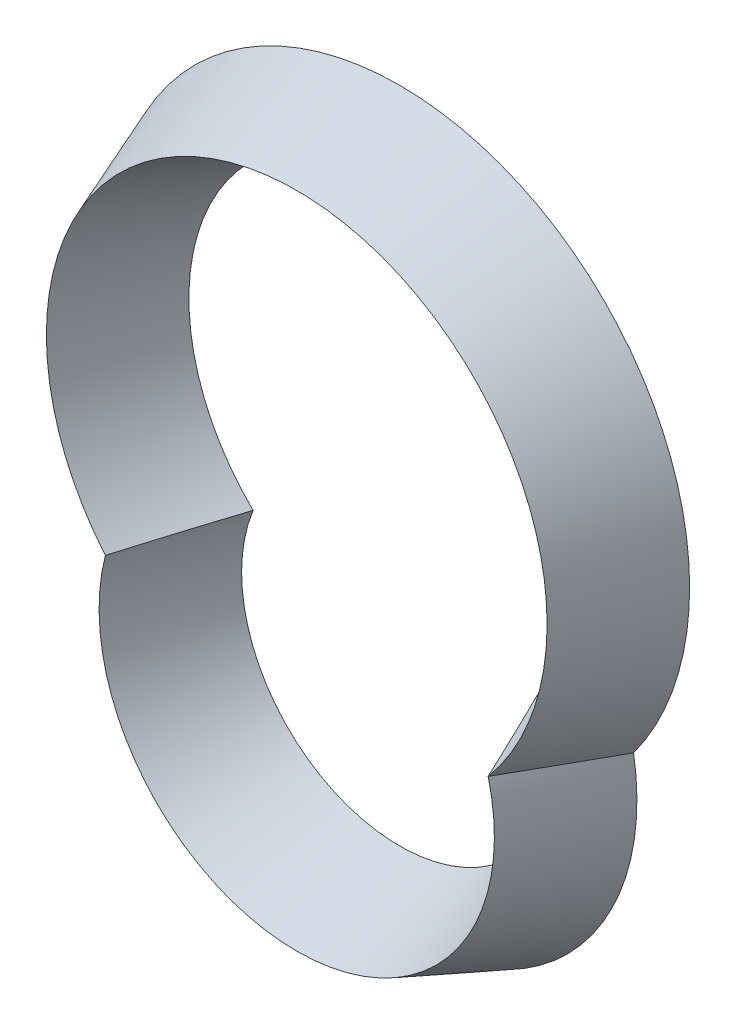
ISO-10303-21;
HEADER;
FILE_DESCRIPTION(('STEP AP214'),'2;1');
FILE_NAME('part.step','',(''),(''),'','','');
FILE_SCHEMA(('AUTOMOTIVE_DESIGN { 1 0 10303 214 1 1 1 1 }'));
ENDSEC;
DATA;
#1=APPLICATION_CONTEXT('core data for automotive mechanical design processes');
#2=APPLICATION_PROTOCOL_DEFINITION('international standard','automotive_design',2000,#1);
#3=PRODUCT_CONTEXT('',#1,'mechanical');
#4=PRODUCT('Part','Part','',(#3));
#5=PRODUCT_RELATED_PRODUCT_CATEGORY('part','',(#4));
#6=PRODUCT_DEFINITION_FORMATION('','',#4);
#7=PRODUCT_DEFINITION_CONTEXT('part definition',#1,'design');
#8=PRODUCT_DEFINITION('design','',#6,#7);
#9=PRODUCT_DEFINITION_SHAPE('','',#8);
#10=(LENGTH_UNIT() NAMED_UNIT(*) SI_UNIT(.MILLI.,.METRE.));
#11=(NAMED_UNIT(*) PLANE_ANGLE_UNIT() SI_UNIT($,.RADIAN.));
#12=(NAMED_UNIT(*) SI_UNIT($,.STERADIAN.) SOLID_ANGLE_UNIT());
#13=UNCERTAINTY_MEASURE_WITH_UNIT(LENGTH_MEASURE(1.E-05),#10,'distance_accuracy_value','');
#14=(GEOMETRIC_REPRESENTATION_CONTEXT(3) GLOBAL_UNCERTAINTY_ASSIGNED_CONTEXT((#13)) GLOBAL_UNIT_ASSIGNED_CONTEXT((#10,
#11,#12)) REPRESENTATION_CONTEXT('',''));
#15=CARTESIAN_POINT('',(0.,0.,0.));
#16=DIRECTION('',(0.,0.,1.));
#17=DIRECTION('',(1.,0.,0.));
#18=AXIS2_PLACEMENT_3D('',#15,#16,#17);
#19=CARTESIAN_POINT('',(27.8107443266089,8.74999999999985,0.));
#20=DIRECTION('',(0.,0.,1.));
#21=DIRECTION('',(1.,0.,0.));
#22=AXIS2_PLACEMENT_3D('',#19,#20,#21);
#23=PLANE('',#22);
#24=CARTESIAN_POINT('',(27.8107443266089,28.7499999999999,0.));
#25=DIRECTION('',(0.,0.,1.));
#26=DIRECTION('',(1.,0.,0.));
#27=AXIS2_PLACEMENT_3D('',#24,#25,#26);
#28=CIRCLE('',#27,55.);
#29=CARTESIAN_POINT('',(72.1813426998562,-3.74999999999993,0.));
#30=VERTEX_POINT('',#29);
#31=CARTESIAN_POINT('',(-16.5598540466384,-3.74999999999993,0.));
#32=VERTEX_POINT('',#31);
#33=EDGE_CURVE('E82',#30,#32,#28,.T.);
#34=ORIENTED_EDGE('',*,*,#33,.F.);
#35=CARTESIAN_POINT('',(27.8107443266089,-11.2500000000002,0.));
#36=DIRECTION('',(0.,0.,1.));
#37=DIRECTION('',(1.,0.,0.));
#38=AXIS2_PLACEMENT_3D('',#35,#36,#37);
#39=CIRCLE('',#38,45.0000000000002);
#40=EDGE_CURVE('E93',#32,#30,#39,.T.);
#41=ORIENTED_EDGE('',*,*,#40,.F.);
#42=EDGE_LOOP('',(#34,#41));
#43=FACE_BOUND('',#42,.T.);
#44=CARTESIAN_POINT('',(27.8107443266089,28.7499999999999,0.));
#45=DIRECTION('',(0.,0.,1.));
#46=DIRECTION('',(1.,0.,0.));
#47=AXIS2_PLACEMENT_3D('',#44,#45,#46);
#48=CIRCLE('',#47,40.);
#49=CARTESIAN_POINT('',(55.6214886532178,0.,0.));
#50=VERTEX_POINT('',#49);
#51=CARTESIAN_POINT('',(0.,0.,0.));
#52=VERTEX_POINT('',#51);
#53=EDGE_CURVE('E79',#50,#52,#48,.T.);
#54=ORIENTED_EDGE('',*,*,#53,.T.);
#55=CARTESIAN_POINT('',(27.8107443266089,-11.2500000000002,0.));
#56=DIRECTION('',(0.,0.,1.));
#57=DIRECTION('',(1.,0.,0.));
#58=AXIS2_PLACEMENT_3D('',#55,#56,#57);
#59=CIRCLE('',#58,30.0000000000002);
#60=EDGE_CURVE('E85',#52,#50,#59,.T.);
#61=ORIENTED_EDGE('',*,*,#60,.T.);
#62=EDGE_LOOP('',(#54,#61));
#63=FACE_BOUND('',#62,.T.);
#64=ADVANCED_FACE('F43',(#43,#63),#23,.F.);
#65=CARTESIAN_POINT('',(27.8107443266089,28.7499999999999,0.));
#66=DIRECTION('',(0.,0.,-1.));
#67=DIRECTION('',(1.,0.,0.));
#68=AXIS2_PLACEMENT_3D('',#65,#66,#67);
#69=CONICAL_SURFACE('',#68,55.,0.36651914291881);
#70=CARTESIAN_POINT('',(27.8107443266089,28.7499999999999,19.5381679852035));
#71=DIRECTION('',(0.,0.,1.));
#72=DIRECTION('',(1.,0.,0.));
#73=AXIS2_PLACEMENT_3D('',#70,#71,#72);
#74=CIRCLE('',#73,47.5);
#75=CARTESIAN_POINT('',(64.1199631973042,-1.87500000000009,19.5381679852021));
#76=VERTEX_POINT('',#75);
#77=CARTESIAN_POINT('',(-8.49847454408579,-1.87499999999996,19.5381679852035));
#78=VERTEX_POINT('',#77);
#79=EDGE_CURVE('E52',#76,#78,#74,.T.);
#80=ORIENTED_EDGE('',*,*,#79,.F.);
#81=CARTESIAN_POINT('',(63.925309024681,-1.83067982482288,20.));
#82=CARTESIAN_POINT('',(64.6259622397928,-1.99012439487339,18.338530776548));
#83=CARTESIAN_POINT('',(65.3228233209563,-2.14972054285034,16.6754820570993));
#84=CARTESIAN_POINT('',(66.7099317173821,-2.46917278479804,13.3466758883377));
#85=CARTESIAN_POINT('',(67.4001791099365,-2.62902887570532,11.6809184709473));
#86=CARTESIAN_POINT('',(68.7750449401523,-2.94896105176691,8.34711121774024));
#87=CARTESIAN_POINT('',(69.459663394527,-3.10903713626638,6.67906138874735));
#88=CARTESIAN_POINT('',(70.824000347,-3.42938196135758,3.34095418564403));
#89=CARTESIAN_POINT('',(71.5037187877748,-3.58965070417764,1.67089678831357));
#90=CARTESIAN_POINT('',(72.1813426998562,-3.74999999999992,0.));
#91=B_SPLINE_CURVE_WITH_KNOTS('',3,(#81,#82,#83,#84,#85,#86,#87,#88,#89,#90),.UNSPECIFIED.,.F.,
.F.,(4,2,2,2,4),(0.,5.43058313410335,10.8611027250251,16.2916061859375,21.7221730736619),.UNSPECIFIED.);
#92=EDGE_CURVE('E96',#76,#30,#91,.T.);
#93=ORIENTED_EDGE('',*,*,#92,.T.);
#94=ORIENTED_EDGE('',*,*,#33,.T.);
#95=CARTESIAN_POINT('',(-8.30382037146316,-1.83067982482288,20.));
#96=CARTESIAN_POINT('',(-9.00447358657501,-1.9901243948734,18.338530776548));
#97=CARTESIAN_POINT('',(-9.7013346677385,-2.14972054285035,16.6754820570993));
#98=CARTESIAN_POINT('',(-11.0884430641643,-2.46917278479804,13.3466758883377));
#99=CARTESIAN_POINT('',(-11.7786904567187,-2.62902887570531,11.6809184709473));
#100=CARTESIAN_POINT('',(-13.1535562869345,-2.9489610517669,8.34711121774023));
#101=CARTESIAN_POINT('',(-13.8381747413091,-3.10903713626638,6.67906138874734));
#102=CARTESIAN_POINT('',(-15.2025116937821,-3.42938196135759,3.34095418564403));
#103=CARTESIAN_POINT('',(-15.8822301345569,-3.58965070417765,1.67089678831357));
#104=CARTESIAN_POINT('',(-16.5598540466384,-3.74999999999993,0.));
#105=B_SPLINE_CURVE_WITH_KNOTS('',3,(#95,#96,#97,#98,#99,#100,#101,#102,#103,#104),
.UNSPECIFIED.,.F.,.F.,(4,2,2,2,4),(0.,5.43058313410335,10.8611027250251,16.2916061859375,
21.7221730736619),.UNSPECIFIED.);
#106=EDGE_CURVE('E97',#78,#32,#105,.T.);
#107=ORIENTED_EDGE('',*,*,#106,.F.);
#108=EDGE_LOOP('',(#80,#93,#94,#107));
#109=FACE_BOUND('',#108,.T.);
#110=ADVANCED_FACE('F108',(#109),#69,.T.);
#111=CARTESIAN_POINT('',(27.8107443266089,-11.2500000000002,0.));
#112=DIRECTION('',(0.,0.,-1.));
#113=DIRECTION('',(1.,0.,0.));
#114=AXIS2_PLACEMENT_3D('',#111,#112,#113);
#115=CONICAL_SURFACE('',#114,45.0000000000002,0.36651914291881);
#116=CARTESIAN_POINT('',(27.8107443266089,-11.2500000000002,19.5381679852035));
#117=DIRECTION('',(0.,0.,1.));
#118=DIRECTION('',(1.,0.,0.));
#119=AXIS2_PLACEMENT_3D('',#116,#117,#118);
#120=CIRCLE('',#119,37.5000000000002);
#121=EDGE_CURVE('E12',#78,#76,#120,.T.);
#122=ORIENTED_EDGE('',*,*,#121,.F.);
#123=ORIENTED_EDGE('',*,*,#106,.T.);
#124=ORIENTED_EDGE('',*,*,#40,.T.);
#125=ORIENTED_EDGE('',*,*,#92,.F.);
#126=EDGE_LOOP('',(#122,#123,#124,#125));
#127=FACE_BOUND('',#126,.T.);
#128=ADVANCED_FACE('F111',(#127),#115,.T.);
#129=CARTESIAN_POINT('',(27.8107443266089,28.7499999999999,0.));
#130=DIRECTION('',(0.,0.,1.));
#131=DIRECTION('',(1.,0.,0.));
#132=AXIS2_PLACEMENT_3D('',#129,#130,#131);
#133=CONICAL_SURFACE('',#132,40.,0.36651914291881);
#134=CARTESIAN_POINT('',(64.3143865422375,-1.91932017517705,20.));
#135=CARTESIAN_POINT('',(63.9620021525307,-1.83894503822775,19.162462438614));
#136=CARTESIAN_POINT('',(63.608669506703,-1.75860788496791,18.3253206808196));
#137=CARTESIAN_POINT('',(62.8999272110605,-1.59801710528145,16.6519075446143));
#138=CARTESIAN_POINT('',(62.5445175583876,-1.51776347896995,15.8156361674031));
#139=CARTESIAN_POINT('',(61.4749361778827,-1.27714684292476,13.3083250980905));
#140=CARTESIAN_POINT('',(60.7573800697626,-1.11692077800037,11.6387124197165));
#141=CARTESIAN_POINT('',(59.672904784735,-0.876916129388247,9.13777847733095));
#142=CARTESIAN_POINT('',(59.3100532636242,-0.796969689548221,8.30470809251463));
#143=CARTESIAN_POINT('',(58.5813529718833,-0.637201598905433,6.6398676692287));
#144=CARTESIAN_POINT('',(58.2155042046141,-0.557379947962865,5.80809762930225));
#145=CARTESIAN_POINT('',(57.4804802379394,-0.397872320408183,4.1459713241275));
#146=CARTESIAN_POINT('',(57.1113048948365,-0.318186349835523,3.31561512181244));
#147=CARTESIAN_POINT('',(56.3692612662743,-0.158971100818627,1.6565355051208));
#148=CARTESIAN_POINT('',(55.9963929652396,-0.0794418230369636,0.827812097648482));
#149=CARTESIAN_POINT('',(55.6214886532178,0.,0.));
#150=B_SPLINE_CURVE_WITH_KNOTS('',3,(#134,#135,#136,#137,#138,#139,#140,#141,#142,#143,#144,
#145,#146,#147,#148,#149),.UNSPECIFIED.,.F.,.F.,(4,2,2,2,2,2,2,4),(0.,2.73659045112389,
5.47318466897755,10.946124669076,13.6826380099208,16.4191482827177,19.1557773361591,
21.8924179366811),.UNSPECIFIED.);
#151=EDGE_CURVE('E83',#76,#50,#150,.T.);
#152=ORIENTED_EDGE('',*,*,#151,.F.);
#153=ORIENTED_EDGE('',*,*,#79,.T.);
#154=CARTESIAN_POINT('',(-8.69289788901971,-1.91932017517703,20.));
#155=CARTESIAN_POINT('',(-8.34051349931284,-1.83894503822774,19.162462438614));
#156=CARTESIAN_POINT('',(-7.98718085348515,-1.75860788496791,18.3253206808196));
#157=CARTESIAN_POINT('',(-7.27843855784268,-1.59801710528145,16.6519075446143));
#158=CARTESIAN_POINT('',(-6.92302890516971,-1.51776347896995,15.8156361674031));
#159=CARTESIAN_POINT('',(-5.85344752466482,-1.27714684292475,13.3083250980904));
#160=CARTESIAN_POINT('',(-5.13589141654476,-1.11692077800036,11.6387124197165));
#161=CARTESIAN_POINT('',(-4.05141613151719,-0.876916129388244,9.13777847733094));
#162=CARTESIAN_POINT('',(-3.68856461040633,-0.796969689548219,8.30470809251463));
#163=CARTESIAN_POINT('',(-2.95986431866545,-0.637201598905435,6.6398676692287));
#164=CARTESIAN_POINT('',(-2.59401555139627,-0.557379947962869,5.80809762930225));
#165=CARTESIAN_POINT('',(-1.85899158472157,-0.397872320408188,4.14597132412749));
#166=CARTESIAN_POINT('',(-1.48981624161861,-0.318186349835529,3.31561512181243));
#167=CARTESIAN_POINT('',(-0.747772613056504,-0.15897110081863,1.65653550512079));
#168=CARTESIAN_POINT('',(-0.374904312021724,-0.079441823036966,0.827812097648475));
#169=CARTESIAN_POINT('',(0.,0.,0.));
#170=B_SPLINE_CURVE_WITH_KNOTS('',3,(#154,#155,#156,#157,#158,#159,#160,#161,#162,#163,#164,
#165,#166,#167,#168,#169),.UNSPECIFIED.,.F.,.F.,(4,2,2,2,2,2,2,4),(0.,2.73659045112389,
5.47318466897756,10.946124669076,13.6826380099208,16.4191482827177,19.1557773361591,
21.8924179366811),.UNSPECIFIED.);
#171=EDGE_CURVE('E75',#78,#52,#170,.T.);
#172=ORIENTED_EDGE('',*,*,#171,.T.);
#173=ORIENTED_EDGE('',*,*,#53,.F.);
#174=EDGE_LOOP('',(#152,#153,#172,#173));
#175=FACE_BOUND('',#174,.T.);
#176=ADVANCED_FACE('F45',(#175),#133,.F.);
#177=CARTESIAN_POINT('',(27.8107443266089,-11.2500000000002,0.));
#178=DIRECTION('',(0.,0.,1.));
#179=DIRECTION('',(1.,0.,0.));
#180=AXIS2_PLACEMENT_3D('',#177,#178,#179);
#181=CONICAL_SURFACE('',#180,30.0000000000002,0.36651914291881);
#182=ORIENTED_EDGE('',*,*,#171,.F.);
#183=ORIENTED_EDGE('',*,*,#121,.T.);
#184=ORIENTED_EDGE('',*,*,#151,.T.);
#185=ORIENTED_EDGE('',*,*,#60,.F.);
#186=EDGE_LOOP('',(#182,#183,#184,#185));
#187=FACE_BOUND('',#186,.T.);
#188=ADVANCED_FACE('F86',(#187),#181,.F.);
#189=CLOSED_SHELL('',(#64,#110,#128,#176,#188));
#190=MANIFOLD_SOLID_BREP('B2',#189);
#191=ADVANCED_BREP_SHAPE_REPRESENTATION('',(#18,#190),#14);
#192=SHAPE_DEFINITION_REPRESENTATION(#9,#191);
ENDSEC;
END-ISO-10303-21;
